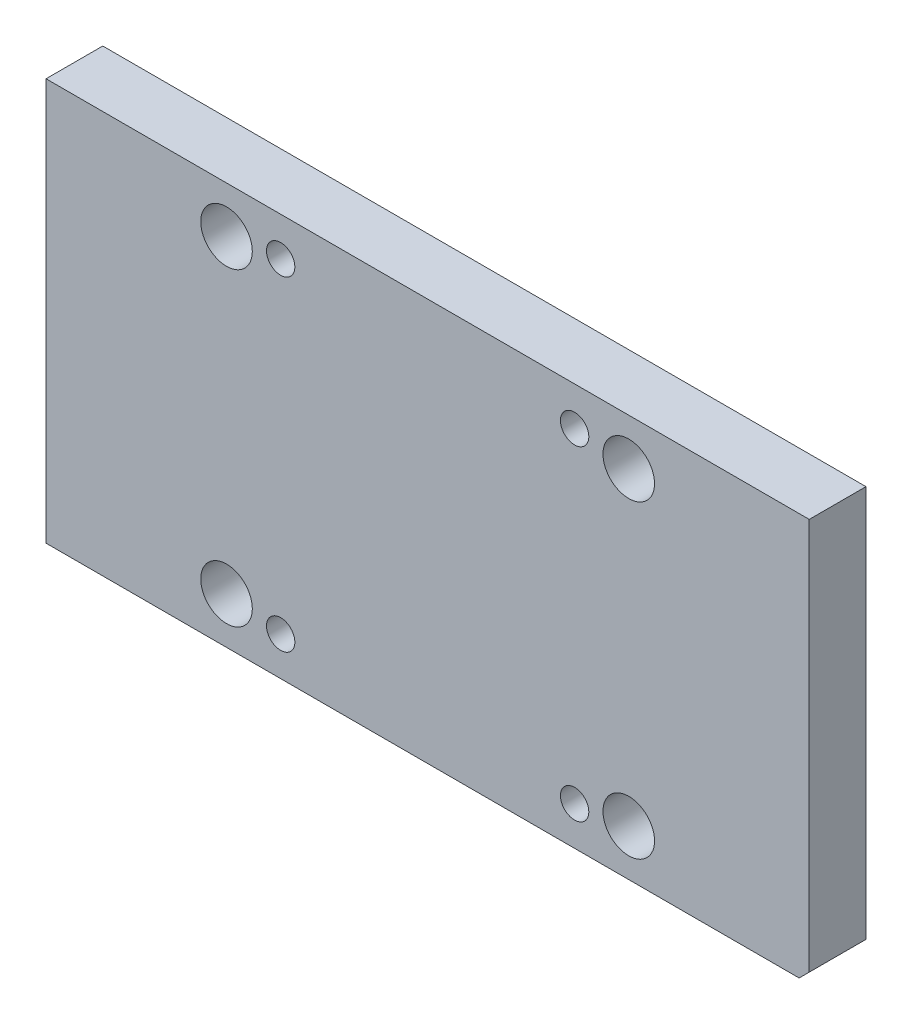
from build123d import *

# Parameters (mm, degrees)
SKETCH1_W            = 296
SKETCH1_H            = 156
BOSS_EXTRUDE1_DEPTH  = 22
DIAMETER_HOLE1_D     = 20
DIAMETER_HOLE1_DEPTH = 22
DIAMETER_HOLE1_TIP   = 6.00860619
HOLE1_D              = 11
HOLE1_CBORE_D        = 18
HOLE1_CBORE_DEPTH    = 13
SKETCH6_R            = 45
CUT_EXTRUDE1_DEPTH   = 4.05
CHAMFER1_SIZE        = 3.92


with BuildPart() as part:
    # Sketch1 → Boss-Extrude1 (new body)
    with BuildSketch(Plane.XY):
        Rectangle(SKETCH1_W, SKETCH1_H)
    extrude(amount=-BOSS_EXTRUDE1_DEPTH)

    # Diameter Hole1
    with Locations(Plane(origin=(-522.991452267, 0, 0), x_dir=(1, 0, 0), z_dir=(0, 0, 1))):
        with Locations((600.991452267, 60), (600.991452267, -60), (444.991452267, -60), (444.991452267, 60)):
            Hole(DIAMETER_HOLE1_D / 2, depth=DIAMETER_HOLE1_DEPTH)
            with Locations((0, 0, -(DIAMETER_HOLE1_DEPTH + DIAMETER_HOLE1_TIP / 2))):  # 118° drill point
                Cone(0, DIAMETER_HOLE1_D / 2, DIAMETER_HOLE1_TIP, mode=Mode.SUBTRACT)

    # Hole1 (through all)
    with Locations(Plane(origin=(0, 0, -22), x_dir=(1, 0, 0), z_dir=(0, 0, -1))):
        with Locations((57, -63), (57, 63), (-57, 63), (-57, -63)):
            CounterBoreHole(HOLE1_D / 2, HOLE1_CBORE_D / 2, HOLE1_CBORE_DEPTH)

    # Sketch6 → Cut-Extrude1 (cut)
    with BuildSketch(Plane.XY.offset(-22)):
        Circle(SKETCH6_R)
    extrude(amount=CUT_EXTRUDE1_DEPTH, mode=Mode.SUBTRACT)

    # Chamfer1
    chamfer1_edges = [part.edges().sort_by_distance(p)[0] for p in [
        (148, -78, -11),
    ]]
    chamfer(chamfer1_edges, length=CHAMFER1_SIZE)


solid = part.part
